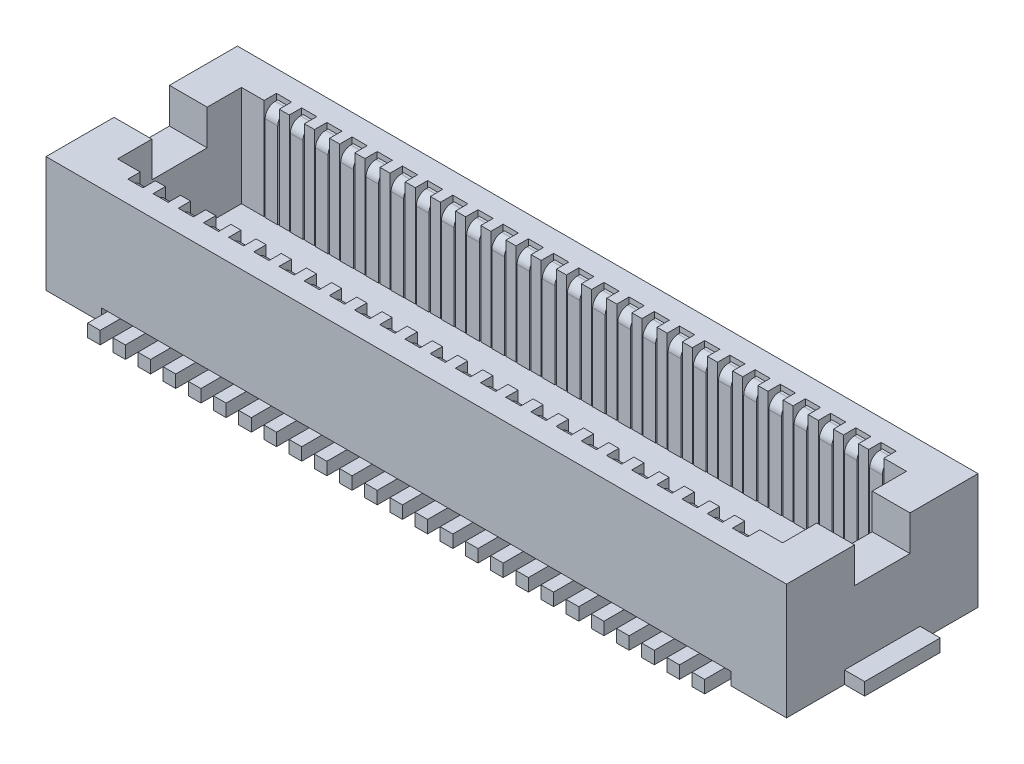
from build123d import *

# Parameters (mm, degrees)
SKETCH_1_W               = 14.7
SKETCH_1_H               = 3.8
EXTRUDE_1_DEPTH          = 2.3
CUT_EXTRUDE_2_DEPTH      = 8.93237039
CUT_EXTRUDE_2_DEPTH_BACK = 8.93237039
SKETCH_2_W               = 12.5
SKETCH_2_H               = 0.25
SKETCH_3_W               = 13.2
SKETCH_3_H               = 2.46
CUT_EXTRUDE_3_DEPTH      = 2
SKETCH_4_W               = 0.75
SKETCH_4_H               = 1.1
CUT_EXTRUDE_4_DEPTH      = 0.7
SKETCH_5_W               = 2.95
SKETCH_5_H               = 2
CUT_EXTRUDE_5_DEPTH      = 0.15
PATTERN_LINEAR_1_COUNT   = 25
PATTERN_LINEAR_1_PITCH   = 0.5
EXTRUDE_6_DEPTH          = 0.125
PATTERN_LINEAR_2_COUNT   = 25
PATTERN_LINEAR_2_PITCH   = 0.5
SKETCH_8_W               = 0.4
SKETCH_8_H               = 1.5
FITING_DEPTH             = 0.25


with BuildPart() as part:
    # Sketch 1 → Extrude 1 (new body)
    with BuildSketch(Plane(origin=(0, 0, 0), x_dir=(1, 0, 0), z_dir=(0, 1, 0))):
        Rectangle(SKETCH_1_W, SKETCH_1_H)
    extrude(amount=EXTRUDE_1_DEPTH)

    # Sketch 2 → Cut-Extrude 2 (cut, two sides: drawn at the far end of the back side and taken through both)
    with BuildSketch(Plane.XY.offset(-CUT_EXTRUDE_2_DEPTH_BACK)):
        with Locations((0, 0.125)):
            Rectangle(SKETCH_2_W, SKETCH_2_H)
    extrude(amount=CUT_EXTRUDE_2_DEPTH + CUT_EXTRUDE_2_DEPTH_BACK, mode=Mode.SUBTRACT)

    # Sketch 3 → Cut-Extrude 3 (cut)
    with BuildSketch(Plane(origin=(0, 2.3, 0), x_dir=(1, 0, 0), z_dir=(0, 1, 0))):
        Rectangle(SKETCH_3_W, SKETCH_3_H)
    extrude(amount=-CUT_EXTRUDE_3_DEPTH, mode=Mode.SUBTRACT)

    # Sketch 4 → Cut-Extrude 4 (cut)
    with BuildSketch(Plane(origin=(0, 2.3, 0), x_dir=(1, 0, 0), z_dir=(0, 1, 0))):
        with Locations((-6.975, 0)):
            Rectangle(SKETCH_4_W, SKETCH_4_H)
        with Locations((6.975, 0)):
            Rectangle(SKETCH_4_W, SKETCH_4_H)
    extrude(amount=-CUT_EXTRUDE_4_DEPTH, mode=Mode.SUBTRACT)

    # Sketch 5 → Cut-Extrude 5 (cut, symmetric)
    with BuildSketch(Plane(origin=(-6, 0, 0), x_dir=(0, 0, -1), z_dir=(1, 0, 0))):
        with Locations((0, 1.3)):
            Rectangle(SKETCH_5_W, SKETCH_5_H)
    cut_extrude_5 = extrude(amount=CUT_EXTRUDE_5_DEPTH, both=True, mode=Mode.SUBTRACT)

    # Pattern Linear 1: Cut-Extrude 5 ×25
    with Locations(*[(i * PATTERN_LINEAR_1_PITCH, 0, 0) for i in range(1, PATTERN_LINEAR_1_COUNT)]):
        add(cut_extrude_5, mode=Mode.SUBTRACT)

    # Sketch 6 → Extrude 6 (add, symmetric)
    with BuildSketch(Plane(origin=(-6, 0, 0), x_dir=(0, 0, -1), z_dir=(1, 0, 0))):
        with BuildLine():
            Line((-2.3, 0), (-1.525, 0))
            ThreePointArc((-1.525, 0), (-1.312867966, 0.087867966), (-1.225, 0.3))
            Line((-1.225, 0.3), (-1.225, 2))
            ThreePointArc((-1.225, 2), (-1.283578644, 2.141421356), (-1.425, 2.2))
            Line((-1.425, 2.2), (-1.475, 2.2))
            Line((-1.475, 2.2), (-1.475, 0.3))
            ThreePointArc((-1.475, 0.3), (-1.489644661, 0.264644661), (-1.525, 0.25))
            Line((-1.525, 0.25), (-2.3, 0.25))
            Line((-2.3, 0.25), (-2.3, 0))
        make_face()
        with BuildLine():
            Line((2.3, 0.25), (2.3, 0))
            Line((2.3, 0), (1.525, 0))
            ThreePointArc((1.525, 0), (1.312867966, 0.087867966), (1.225, 0.3))
            Line((1.225, 0.3), (1.225, 2))
            ThreePointArc((1.225, 2), (1.283578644, 2.141421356), (1.425, 2.2))
            Line((1.425, 2.2), (1.475, 2.2))
            Line((1.475, 2.2), (1.475, 0.3))
            ThreePointArc((1.475, 0.3), (1.489644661, 0.264644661), (1.525, 0.25))
            Line((1.525, 0.25), (2.3, 0.25))
        make_face()
    extrude_6 = extrude(amount=EXTRUDE_6_DEPTH, both=True)

    # Pattern Linear 2: Extrude 6 ×25
    with Locations(*[(i * PATTERN_LINEAR_2_PITCH, 0, 0) for i in range(1, PATTERN_LINEAR_2_COUNT)]):
        add(extrude_6)

    # Sketch 8 → Fiting (add)
    with BuildSketch(Plane(origin=(0, 0, 0), x_dir=(1, 0, 0), z_dir=(0, 1, 0))):
        with Locations((-7.55, 0)):
            Rectangle(SKETCH_8_W, SKETCH_8_H)
        with Locations((7.55, 0)):
            Rectangle(SKETCH_8_W, SKETCH_8_H)
    extrude(amount=FITING_DEPTH)


solid = part.part
